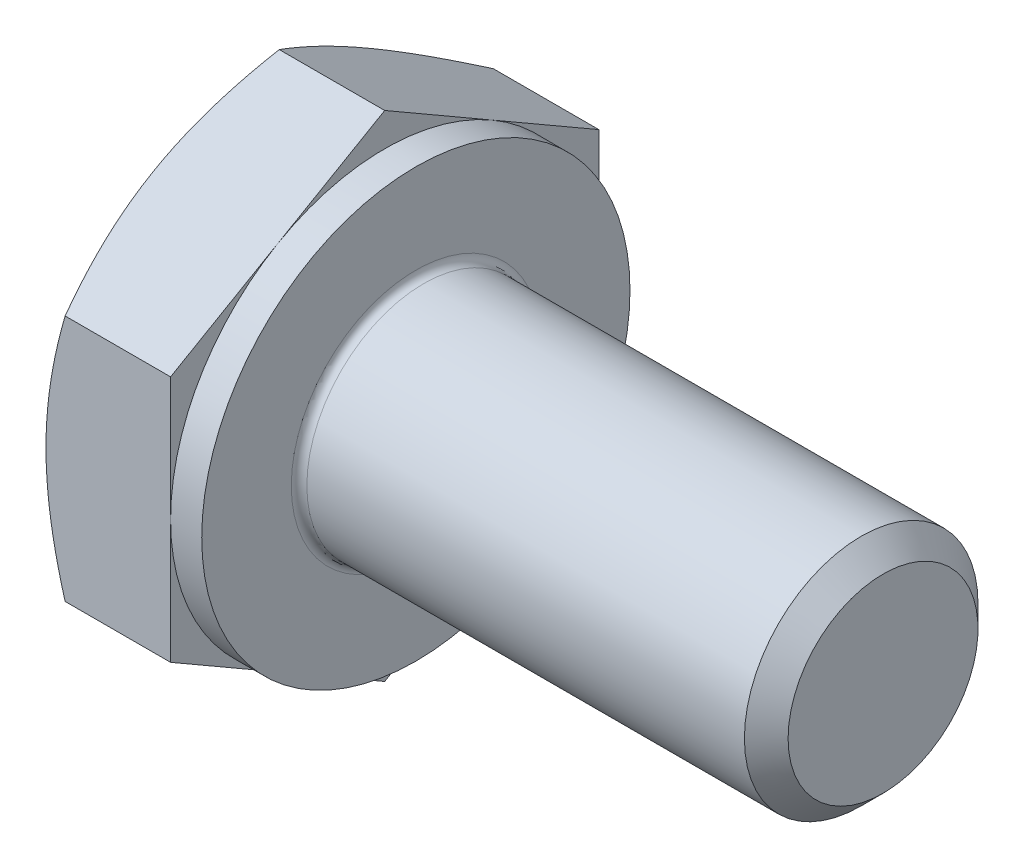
ISO-10303-21;
HEADER;
FILE_DESCRIPTION(('STEP AP214'),'2;1');
FILE_NAME('part.step','',(''),(''),'','','');
FILE_SCHEMA(('AUTOMOTIVE_DESIGN { 1 0 10303 214 1 1 1 1 }'));
ENDSEC;
DATA;
#1=APPLICATION_CONTEXT('core data for automotive mechanical design processes');
#2=APPLICATION_PROTOCOL_DEFINITION('international standard','automotive_design',2000,#1);
#3=PRODUCT_CONTEXT('',#1,'mechanical');
#4=PRODUCT('Part','Part','',(#3));
#5=PRODUCT_RELATED_PRODUCT_CATEGORY('part','',(#4));
#6=PRODUCT_DEFINITION_FORMATION('','',#4);
#7=PRODUCT_DEFINITION_CONTEXT('part definition',#1,'design');
#8=PRODUCT_DEFINITION('design','',#6,#7);
#9=PRODUCT_DEFINITION_SHAPE('','',#8);
#10=(LENGTH_UNIT() NAMED_UNIT(*) SI_UNIT(.MILLI.,.METRE.));
#11=(NAMED_UNIT(*) PLANE_ANGLE_UNIT() SI_UNIT($,.RADIAN.));
#12=(NAMED_UNIT(*) SI_UNIT($,.STERADIAN.) SOLID_ANGLE_UNIT());
#13=UNCERTAINTY_MEASURE_WITH_UNIT(LENGTH_MEASURE(1.E-05),#10,'distance_accuracy_value','');
#14=(GEOMETRIC_REPRESENTATION_CONTEXT(3) GLOBAL_UNCERTAINTY_ASSIGNED_CONTEXT((#13)) GLOBAL_UNIT_ASSIGNED_CONTEXT((#10,
#11,#12)) REPRESENTATION_CONTEXT('',''));
#15=CARTESIAN_POINT('',(0.,0.,0.));
#16=DIRECTION('',(0.,0.,1.));
#17=DIRECTION('',(1.,0.,0.));
#18=AXIS2_PLACEMENT_3D('',#15,#16,#17);
#19=CARTESIAN_POINT('',(2.,3.17542648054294,0.));
#20=DIRECTION('',(1.,0.,0.));
#21=DIRECTION('',(0.,0.,-1.));
#22=AXIS2_PLACEMENT_3D('',#19,#20,#21);
#23=PLANE('',#22);
#24=CARTESIAN_POINT('',(2.,0.,0.));
#25=DIRECTION('',(1.,0.,0.));
#26=DIRECTION('',(0.,0.,-1.));
#27=AXIS2_PLACEMENT_3D('',#24,#25,#26);
#28=CIRCLE('',#27,1.6);
#29=CARTESIAN_POINT('',(2.,0.,-1.6));
#30=VERTEX_POINT('',#29);
#31=EDGE_CURVE('E44',#30,#30,#28,.F.);
#32=ORIENTED_EDGE('',*,*,#31,.T.);
#33=EDGE_LOOP('',(#32));
#34=FACE_BOUND('',#33,.T.);
#35=CARTESIAN_POINT('',(2.,0.,0.));
#36=DIRECTION('',(1.,0.,0.));
#37=DIRECTION('',(0.,0.,-1.));
#38=AXIS2_PLACEMENT_3D('',#35,#36,#37);
#39=CIRCLE('',#38,2.75);
#40=CARTESIAN_POINT('',(2.,0.,-2.75));
#41=VERTEX_POINT('',#40);
#42=EDGE_CURVE('E301',#41,#41,#39,.T.);
#43=ORIENTED_EDGE('',*,*,#42,.T.);
#44=EDGE_LOOP('',(#43));
#45=FACE_BOUND('',#44,.T.);
#46=ADVANCED_FACE('F36',(#34,#45),#23,.T.);
#47=CARTESIAN_POINT('',(0.,0.,0.));
#48=DIRECTION('',(-1.,0.,0.));
#49=DIRECTION('',(0.,0.,1.));
#50=AXIS2_PLACEMENT_3D('',#47,#48,#49);
#51=CYLINDRICAL_SURFACE('',#50,1.5);
#52=CARTESIAN_POINT('',(2.1,0.,0.));
#53=DIRECTION('',(1.,0.,0.));
#54=DIRECTION('',(0.,0.,-1.));
#55=AXIS2_PLACEMENT_3D('',#52,#53,#54);
#56=CIRCLE('',#55,1.5);
#57=CARTESIAN_POINT('',(2.1,0.,-1.5));
#58=VERTEX_POINT('',#57);
#59=EDGE_CURVE('E11',#58,#58,#56,.T.);
#60=ORIENTED_EDGE('',*,*,#59,.T.);
#61=EDGE_LOOP('',(#60));
#62=FACE_BOUND('',#61,.T.);
#63=CARTESIAN_POINT('',(7.71950000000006,0.,0.));
#64=DIRECTION('',(-1.,0.,0.));
#65=DIRECTION('',(0.,0.,1.));
#66=AXIS2_PLACEMENT_3D('',#63,#64,#65);
#67=CIRCLE('',#66,1.5);
#68=CARTESIAN_POINT('',(7.71950000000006,0.,1.5));
#69=VERTEX_POINT('',#68);
#70=EDGE_CURVE('E280',#69,#69,#67,.T.);
#71=ORIENTED_EDGE('',*,*,#70,.T.);
#72=EDGE_LOOP('',(#71));
#73=FACE_BOUND('',#72,.T.);
#74=ADVANCED_FACE('F254',(#62,#73),#51,.T.);
#75=CARTESIAN_POINT('',(8.00000000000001,0.,0.));
#76=DIRECTION('',(-1.,0.,0.));
#77=DIRECTION('',(0.,0.,1.));
#78=AXIS2_PLACEMENT_3D('',#75,#76,#77);
#79=CONICAL_SURFACE('',#78,1.2195,0.785398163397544);
#80=ORIENTED_EDGE('',*,*,#70,.F.);
#81=EDGE_LOOP('',(#80));
#82=FACE_BOUND('',#81,.T.);
#83=CARTESIAN_POINT('',(8.00000000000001,0.,0.));
#84=DIRECTION('',(-1.,0.,0.));
#85=DIRECTION('',(0.,0.,1.));
#86=AXIS2_PLACEMENT_3D('',#83,#84,#85);
#87=CIRCLE('',#86,1.2195);
#88=CARTESIAN_POINT('',(8.00000000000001,0.,1.2195));
#89=VERTEX_POINT('',#88);
#90=EDGE_CURVE('E278',#89,#89,#87,.T.);
#91=ORIENTED_EDGE('',*,*,#90,.T.);
#92=EDGE_LOOP('',(#91));
#93=FACE_BOUND('',#92,.T.);
#94=ADVANCED_FACE('F259',(#82,#93),#79,.T.);
#95=CARTESIAN_POINT('',(8.00000000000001,0.,0.));
#96=DIRECTION('',(-1.,0.,0.));
#97=DIRECTION('',(0.,0.,1.));
#98=AXIS2_PLACEMENT_3D('',#95,#96,#97);
#99=PLANE('',#98);
#100=ORIENTED_EDGE('',*,*,#90,.F.);
#101=EDGE_LOOP('',(#100));
#102=FACE_BOUND('',#101,.T.);
#103=ADVANCED_FACE('F266',(#102),#99,.F.);
#104=CARTESIAN_POINT('',(1.6,2.75,0.));
#105=DIRECTION('',(1.,0.,0.));
#106=DIRECTION('',(0.,0.,-1.));
#107=AXIS2_PLACEMENT_3D('',#104,#105,#106);
#108=PLANE('',#107);
#109=DIRECTION('',(0.,0.500000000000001,0.866025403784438));
#110=VECTOR('',#109,1.);
#111=CARTESIAN_POINT('',(1.6,1.58771324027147,-2.75));
#112=LINE('',#111,#110);
#113=CARTESIAN_POINT('',(1.6,1.58771324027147,-2.75));
#114=VERTEX_POINT('',#113);
#115=CARTESIAN_POINT('',(1.6,2.3815698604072,-1.375));
#116=VERTEX_POINT('',#115);
#117=EDGE_CURVE('E168',#114,#116,#112,.T.);
#118=ORIENTED_EDGE('',*,*,#117,.T.);
#119=CARTESIAN_POINT('',(1.6,0.,0.));
#120=DIRECTION('',(-1.,0.,0.));
#121=DIRECTION('',(0.,0.,1.));
#122=AXIS2_PLACEMENT_3D('',#119,#120,#121);
#123=CIRCLE('',#122,2.75);
#124=CARTESIAN_POINT('',(1.6,0.,-2.75));
#125=VERTEX_POINT('',#124);
#126=EDGE_CURVE('E51',#116,#125,#123,.T.);
#127=ORIENTED_EDGE('',*,*,#126,.T.);
#128=DIRECTION('',(0.,1.,0.));
#129=VECTOR('',#128,1.);
#130=CARTESIAN_POINT('',(1.6,1.58771324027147,-2.75));
#131=LINE('',#130,#129);
#132=EDGE_CURVE('E304',#125,#114,#131,.T.);
#133=ORIENTED_EDGE('',*,*,#132,.T.);
#134=EDGE_LOOP('',(#118,#127,#133));
#135=FACE_BOUND('',#134,.T.);
#136=ADVANCED_FACE('F269',(#135),#108,.T.);
#137=CARTESIAN_POINT('',(1.6,3.17542648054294,0.));
#138=VERTEX_POINT('',#137);
#139=EDGE_CURVE('E166',#116,#138,#112,.T.);
#140=ORIENTED_EDGE('',*,*,#139,.T.);
#141=DIRECTION('',(0.,-0.5,0.866025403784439));
#142=VECTOR('',#141,1.);
#143=CARTESIAN_POINT('',(1.6,3.17542648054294,0.));
#144=LINE('',#143,#142);
#145=CARTESIAN_POINT('',(1.6,2.38156986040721,1.375));
#146=VERTEX_POINT('',#145);
#147=EDGE_CURVE('E165',#138,#146,#144,.T.);
#148=ORIENTED_EDGE('',*,*,#147,.T.);
#149=EDGE_CURVE('E154',#146,#116,#123,.T.);
#150=ORIENTED_EDGE('',*,*,#149,.T.);
#151=EDGE_LOOP('',(#140,#148,#150));
#152=FACE_BOUND('',#151,.T.);
#153=ADVANCED_FACE('F274',(#152),#108,.T.);
#154=CARTESIAN_POINT('',(1.6,1.58771324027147,2.75));
#155=VERTEX_POINT('',#154);
#156=EDGE_CURVE('E133',#146,#155,#144,.T.);
#157=ORIENTED_EDGE('',*,*,#156,.T.);
#158=DIRECTION('',(0.,-1.,0.));
#159=VECTOR('',#158,1.);
#160=CARTESIAN_POINT('',(1.6,1.58771324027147,2.75));
#161=LINE('',#160,#159);
#162=CARTESIAN_POINT('',(1.6,0.,2.75));
#163=VERTEX_POINT('',#162);
#164=EDGE_CURVE('E127',#155,#163,#161,.T.);
#165=ORIENTED_EDGE('',*,*,#164,.T.);
#166=EDGE_CURVE('E131',#163,#146,#123,.T.);
#167=ORIENTED_EDGE('',*,*,#166,.T.);
#168=EDGE_LOOP('',(#157,#165,#167));
#169=FACE_BOUND('',#168,.T.);
#170=ADVANCED_FACE('F129',(#169),#108,.T.);
#171=CARTESIAN_POINT('',(1.6,-1.58771324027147,2.75));
#172=VERTEX_POINT('',#171);
#173=EDGE_CURVE('E137',#163,#172,#161,.T.);
#174=ORIENTED_EDGE('',*,*,#173,.T.);
#175=DIRECTION('',(0.,-0.500000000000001,-0.866025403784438));
#176=VECTOR('',#175,1.);
#177=CARTESIAN_POINT('',(1.6,-3.17542648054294,0.));
#178=LINE('',#177,#176);
#179=CARTESIAN_POINT('',(1.6,-2.3815698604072,1.375));
#180=VERTEX_POINT('',#179);
#181=EDGE_CURVE('E144',#172,#180,#178,.T.);
#182=ORIENTED_EDGE('',*,*,#181,.T.);
#183=EDGE_CURVE('E141',#180,#163,#123,.T.);
#184=ORIENTED_EDGE('',*,*,#183,.T.);
#185=EDGE_LOOP('',(#174,#182,#184));
#186=FACE_BOUND('',#185,.T.);
#187=ADVANCED_FACE('F142',(#186),#108,.T.);
#188=CARTESIAN_POINT('',(1.6,-3.17542648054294,0.));
#189=VERTEX_POINT('',#188);
#190=EDGE_CURVE('E160',#180,#189,#178,.T.);
#191=ORIENTED_EDGE('',*,*,#190,.T.);
#192=DIRECTION('',(0.,0.499999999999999,-0.866025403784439));
#193=VECTOR('',#192,1.);
#194=CARTESIAN_POINT('',(1.6,-1.58771324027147,-2.75));
#195=LINE('',#194,#193);
#196=CARTESIAN_POINT('',(1.6,-2.38156986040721,-1.375));
#197=VERTEX_POINT('',#196);
#198=EDGE_CURVE('E342',#189,#197,#195,.T.);
#199=ORIENTED_EDGE('',*,*,#198,.T.);
#200=EDGE_CURVE('E148',#197,#180,#123,.T.);
#201=ORIENTED_EDGE('',*,*,#200,.T.);
#202=EDGE_LOOP('',(#191,#199,#201));
#203=FACE_BOUND('',#202,.T.);
#204=ADVANCED_FACE('F343',(#203),#108,.T.);
#205=CARTESIAN_POINT('',(1.6,-1.58771324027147,-2.75));
#206=VERTEX_POINT('',#205);
#207=EDGE_CURVE('E155',#197,#206,#195,.T.);
#208=ORIENTED_EDGE('',*,*,#207,.T.);
#209=EDGE_CURVE('E305',#206,#125,#131,.T.);
#210=ORIENTED_EDGE('',*,*,#209,.T.);
#211=EDGE_CURVE('E312',#125,#197,#123,.T.);
#212=ORIENTED_EDGE('',*,*,#211,.T.);
#213=EDGE_LOOP('',(#208,#210,#212));
#214=FACE_BOUND('',#213,.T.);
#215=ADVANCED_FACE('F275',(#214),#108,.T.);
#216=CARTESIAN_POINT('',(0.,0.,0.));
#217=DIRECTION('',(-1.,0.,0.));
#218=DIRECTION('',(0.,0.,1.));
#219=AXIS2_PLACEMENT_3D('',#216,#217,#218);
#220=CYLINDRICAL_SURFACE('',#219,2.75);
#221=ORIENTED_EDGE('',*,*,#126,.F.);
#222=ORIENTED_EDGE('',*,*,#149,.F.);
#223=ORIENTED_EDGE('',*,*,#166,.F.);
#224=ORIENTED_EDGE('',*,*,#183,.F.);
#225=ORIENTED_EDGE('',*,*,#200,.F.);
#226=ORIENTED_EDGE('',*,*,#211,.F.);
#227=EDGE_LOOP('',(#221,#222,#223,#224,#225,#226));
#228=FACE_BOUND('',#227,.T.);
#229=ORIENTED_EDGE('',*,*,#42,.F.);
#230=EDGE_LOOP('',(#229));
#231=FACE_BOUND('',#230,.T.);
#232=ADVANCED_FACE('F151',(#228,#231),#220,.T.);
#233=CARTESIAN_POINT('',(0.,3.17542648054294,0.));
#234=DIRECTION('',(1.,0.,0.));
#235=DIRECTION('',(0.,0.,-1.));
#236=AXIS2_PLACEMENT_3D('',#233,#234,#235);
#237=PLANE('',#236);
#238=CARTESIAN_POINT('',(0.,0.,0.));
#239=DIRECTION('',(1.,0.,0.));
#240=DIRECTION('',(0.,0.,-1.));
#241=AXIS2_PLACEMENT_3D('',#238,#239,#240);
#242=CIRCLE('',#241,2.75);
#243=CARTESIAN_POINT('',(0.,0.,-2.75));
#244=VERTEX_POINT('',#243);
#245=CARTESIAN_POINT('',(0.,2.3815698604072,-1.375));
#246=VERTEX_POINT('',#245);
#247=EDGE_CURVE('E300',#244,#246,#242,.T.);
#248=ORIENTED_EDGE('',*,*,#247,.F.);
#249=CARTESIAN_POINT('',(0.,-2.38156986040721,-1.375));
#250=VERTEX_POINT('',#249);
#251=EDGE_CURVE('E296',#250,#244,#242,.T.);
#252=ORIENTED_EDGE('',*,*,#251,.F.);
#253=CARTESIAN_POINT('',(0.,-2.3815698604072,1.375));
#254=VERTEX_POINT('',#253);
#255=EDGE_CURVE('E299',#254,#250,#242,.T.);
#256=ORIENTED_EDGE('',*,*,#255,.F.);
#257=CARTESIAN_POINT('',(0.,0.,2.75));
#258=VERTEX_POINT('',#257);
#259=EDGE_CURVE('E335',#258,#254,#242,.T.);
#260=ORIENTED_EDGE('',*,*,#259,.F.);
#261=CARTESIAN_POINT('',(0.,0.,0.));
#262=DIRECTION('',(-1.,0.,0.));
#263=DIRECTION('',(0.,0.,1.));
#264=AXIS2_PLACEMENT_3D('',#261,#262,#263);
#265=CIRCLE('',#264,2.75);
#266=CARTESIAN_POINT('',(0.,2.38156986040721,1.375));
#267=VERTEX_POINT('',#266);
#268=EDGE_CURVE('E169',#258,#267,#265,.T.);
#269=ORIENTED_EDGE('',*,*,#268,.T.);
#270=EDGE_CURVE('E358',#246,#267,#242,.T.);
#271=ORIENTED_EDGE('',*,*,#270,.F.);
#272=EDGE_LOOP('',(#248,#252,#256,#260,#269,#271));
#273=FACE_BOUND('',#272,.T.);
#274=ADVANCED_FACE('F200',(#273),#237,.F.);
#275=CARTESIAN_POINT('',(0.,0.,0.));
#276=DIRECTION('',(1.,0.,0.));
#277=DIRECTION('',(0.,0.,-1.));
#278=AXIS2_PLACEMENT_3D('',#275,#276,#277);
#279=CONICAL_SURFACE('',#278,2.75,1.0471975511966);
#280=CARTESIAN_POINT('',(0.24568676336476,1.58759777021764,2.7502));
#281=CARTESIAN_POINT('',(0.205387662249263,1.65737010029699,2.62935077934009));
#282=CARTESIAN_POINT('',(0.168736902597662,1.72774469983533,2.50745839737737));
#283=CARTESIAN_POINT('',(0.104762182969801,1.86971254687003,2.26156287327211));
#284=CARTESIAN_POINT('',(0.0774608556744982,1.94130831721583,2.13755536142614));
#285=CARTESIAN_POINT('',(0.034961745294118,2.08361254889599,1.89107720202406));
#286=CARTESIAN_POINT('',(0.019481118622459,2.15429911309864,1.76864448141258));
#287=CARTESIAN_POINT('',(0.000999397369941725,2.29600490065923,1.52320285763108));
#288=CARTESIAN_POINT('',(-0.00201700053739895,2.36702360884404,1.40019484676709));
#289=CARTESIAN_POINT('',(0.0042531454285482,2.49972966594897,1.17034121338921));
#290=CARTESIAN_POINT('',(0.012000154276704,2.56143686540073,1.06346120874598));
#291=CARTESIAN_POINT('',(0.0365551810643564,2.68444923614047,0.85039753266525));
#292=CARTESIAN_POINT('',(0.0533715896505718,2.74575398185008,0.74421459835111));
#293=CARTESIAN_POINT('',(0.0954119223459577,2.86902004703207,0.530711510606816));
#294=CARTESIAN_POINT('',(0.120814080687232,2.93096576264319,0.423418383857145));
#295=CARTESIAN_POINT('',(0.178467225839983,3.05393320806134,0.210432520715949));
#296=CARTESIAN_POINT('',(0.210704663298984,3.11495651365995,0.104737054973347));
#297=CARTESIAN_POINT('',(0.245686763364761,3.17554195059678,-0.00020000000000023));
#298=B_SPLINE_CURVE_WITH_KNOTS('',3,(#280,#281,#282,#283,#284,#285,#286,#287,#288,#289,#290,
#291,#292,#293,#294,#295,#296,#297),.UNSPECIFIED.,.F.,.F.,(4,2,2,2,2,2,2,2,4),(0.,
0.435912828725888,0.872873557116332,1.29901931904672,1.72464171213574,2.09526089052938,
2.46622354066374,2.84541551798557,3.22386274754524),.UNSPECIFIED.);
#299=CARTESIAN_POINT('',(0.245620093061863,3.17542648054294,0.));
#300=VERTEX_POINT('',#299);
#301=EDGE_CURVE('E220',#267,#300,#298,.T.);
#302=ORIENTED_EDGE('',*,*,#301,.T.);
#303=CARTESIAN_POINT('',(0.245686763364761,3.17554195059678,0.0002));
#304=CARTESIAN_POINT('',(0.205387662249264,3.10576962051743,-0.120649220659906));
#305=CARTESIAN_POINT('',(0.168736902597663,3.03539502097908,-0.242541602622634));
#306=CARTESIAN_POINT('',(0.104762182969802,2.89342717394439,-0.488437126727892));
#307=CARTESIAN_POINT('',(0.0774608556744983,2.82183140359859,-0.612444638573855));
#308=CARTESIAN_POINT('',(0.0349617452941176,2.67952717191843,-0.858922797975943));
#309=CARTESIAN_POINT('',(0.0194811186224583,2.60884060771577,-0.981355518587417));
#310=CARTESIAN_POINT('',(0.000999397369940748,2.46713482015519,-1.22679714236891));
#311=CARTESIAN_POINT('',(-0.00201700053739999,2.39611611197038,-1.34980515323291));
#312=CARTESIAN_POINT('',(0.00425314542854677,2.26341005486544,-1.57965878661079));
#313=CARTESIAN_POINT('',(0.0120001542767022,2.20170285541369,-1.68653879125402));
#314=CARTESIAN_POINT('',(0.0365551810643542,2.07869048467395,-1.89960246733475));
#315=CARTESIAN_POINT('',(0.0533715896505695,2.01738573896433,-2.00578540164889));
#316=CARTESIAN_POINT('',(0.0954119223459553,1.89411967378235,-2.21928848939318));
#317=CARTESIAN_POINT('',(0.12081408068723,1.83217395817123,-2.32658161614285));
#318=CARTESIAN_POINT('',(0.178467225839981,1.70920651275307,-2.53956747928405));
#319=CARTESIAN_POINT('',(0.210704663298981,1.64818320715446,-2.64526294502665));
#320=CARTESIAN_POINT('',(0.245686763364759,1.58759777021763,-2.7502));
#321=B_SPLINE_CURVE_WITH_KNOTS('',3,(#303,#304,#305,#306,#307,#308,#309,#310,#311,#312,#313,
#314,#315,#316,#317,#318,#319,#320),.UNSPECIFIED.,.F.,.F.,(4,2,2,2,2,2,2,2,4),(0.,
0.435912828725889,0.872873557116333,1.29901931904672,1.72464171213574,2.09526089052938,
2.46622354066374,2.84541551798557,3.22386274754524),.UNSPECIFIED.);
#322=EDGE_CURVE('E59',#300,#246,#321,.T.);
#323=ORIENTED_EDGE('',*,*,#322,.T.);
#324=ORIENTED_EDGE('',*,*,#270,.T.);
#325=EDGE_LOOP('',(#302,#323,#324));
#326=FACE_BOUND('',#325,.T.);
#327=ADVANCED_FACE('F359',(#326),#279,.T.);
#328=CARTESIAN_POINT('',(1.36715210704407,-4.31638594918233,2.75));
#329=CARTESIAN_POINT('',(1.30845994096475,-4.19581737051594,2.75));
#330=CARTESIAN_POINT('',(1.25031586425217,-4.07497746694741,2.75));
#331=CARTESIAN_POINT('',(1.1354311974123,-3.83261088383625,2.75));
#332=CARTESIAN_POINT('',(1.07869081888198,-3.71108410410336,2.75));
#333=CARTESIAN_POINT('',(0.966646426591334,-3.46659808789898,2.75));
#334=CARTESIAN_POINT('',(0.911351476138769,-3.34363468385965,2.75));
#335=CARTESIAN_POINT('',(0.802956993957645,-3.09674757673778,2.75));
#336=CARTESIAN_POINT('',(0.749857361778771,-2.97282391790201,2.75));
#337=CARTESIAN_POINT('',(0.644703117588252,-2.71965806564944,2.75));
#338=CARTESIAN_POINT('',(0.592742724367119,-2.59037652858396,2.75));
#339=CARTESIAN_POINT('',(0.492631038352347,-2.33032018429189,2.75));
#340=CARTESIAN_POINT('',(0.444480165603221,-2.19954521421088,2.75));
#341=CARTESIAN_POINT('',(0.353213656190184,-1.9365223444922,2.75));
#342=CARTESIAN_POINT('',(0.310088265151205,-1.80427786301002,2.75));
#343=CARTESIAN_POINT('',(0.230222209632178,-1.53789259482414,2.75));
#344=CARTESIAN_POINT('',(0.193479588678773,-1.40375240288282,2.75));
#345=CARTESIAN_POINT('',(0.128302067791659,-1.13423793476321,2.75));
#346=CARTESIAN_POINT('',(0.0998212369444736,-0.998874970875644,2.75));
#347=CARTESIAN_POINT('',(0.0527456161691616,-0.726413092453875,2.75));
#348=CARTESIAN_POINT('',(0.0341497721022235,-0.589314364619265,2.75));
#349=CARTESIAN_POINT('',(0.0085685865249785,-0.315877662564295,2.75));
#350=CARTESIAN_POINT('',(0.00142992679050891,-0.179554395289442,2.75));
#351=CARTESIAN_POINT('',(-0.0010386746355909,0.0932131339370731,2.75));
#352=CARTESIAN_POINT('',(0.00363158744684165,0.229657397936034,2.75));
#353=CARTESIAN_POINT('',(0.0211304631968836,0.459764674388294,2.75));
#354=CARTESIAN_POINT('',(0.0310050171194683,0.553667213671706,2.75));
#355=CARTESIAN_POINT('',(0.0557601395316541,0.740814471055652,2.75));
#356=CARTESIAN_POINT('',(0.0706413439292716,0.834059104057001,2.75));
#357=CARTESIAN_POINT('',(0.122015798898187,1.1126628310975,2.75));
#358=CARTESIAN_POINT('',(0.165231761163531,1.29679769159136,2.75));
#359=CARTESIAN_POINT('',(0.240559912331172,1.57226006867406,2.75));
#360=CARTESIAN_POINT('',(0.267790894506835,1.66500394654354,2.75));
#361=CARTESIAN_POINT('',(0.325176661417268,1.84959145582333,2.75));
#362=CARTESIAN_POINT('',(0.35533146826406,1.94143508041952,2.75));
#363=CARTESIAN_POINT('',(0.418073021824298,2.12425036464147,2.75));
#364=CARTESIAN_POINT('',(0.450659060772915,2.21522226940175,2.75));
#365=CARTESIAN_POINT('',(0.517870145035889,2.39640501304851,2.75));
#366=CARTESIAN_POINT('',(0.552495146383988,2.48661586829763,2.75));
#367=CARTESIAN_POINT('',(0.647111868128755,2.72631941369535,2.75));
#368=CARTESIAN_POINT('',(0.708617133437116,2.87521406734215,2.75));
#369=CARTESIAN_POINT('',(0.835163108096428,3.17149877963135,2.75));
#370=CARTESIAN_POINT('',(0.90020418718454,3.31888867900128,2.75));
#371=CARTESIAN_POINT('',(1.03299372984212,3.61249860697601,2.75));
#372=CARTESIAN_POINT('',(1.1007430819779,3.75871823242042,2.75));
#373=CARTESIAN_POINT('',(1.23832197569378,4.05017738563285,2.75));
#374=CARTESIAN_POINT('',(1.30815157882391,4.19541688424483,2.75));
#375=CARTESIAN_POINT('',(1.5202722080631,4.63039070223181,2.75));
#376=CARTESIAN_POINT('',(1.66499194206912,4.91893915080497,2.75));
#377=CARTESIAN_POINT('',(1.95851426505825,5.49386340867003,2.75));
#378=CARTESIAN_POINT('',(2.10731603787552,5.78023963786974,2.75));
#379=CARTESIAN_POINT('',(2.39216757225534,6.32194576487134,2.75));
#380=CARTESIAN_POINT('',(2.52794261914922,6.57742037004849,2.75));
#381=CARTESIAN_POINT('',(2.80114245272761,7.08750371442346,2.75));
#382=CARTESIAN_POINT('',(2.93856733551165,7.342112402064,2.75));
#383=CARTESIAN_POINT('',(3.21419429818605,7.84983547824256,2.75));
#384=CARTESIAN_POINT('',(3.35239239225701,8.10295203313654,2.75));
#385=CARTESIAN_POINT('',(3.62973059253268,8.60864374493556,2.75));
#386=CARTESIAN_POINT('',(3.76887062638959,8.86121894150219,2.75));
#387=CARTESIAN_POINT('',(3.9083538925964,9.11360311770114,2.75));
#388=B_SPLINE_CURVE_WITH_KNOTS('',3,(#328,#329,#330,#331,#332,#333,#334,#335,#336,#337,#338,
#339,#340,#341,#342,#343,#344,#345,#346,#347,#348,#349,#350,#351,#352,#353,#354,#355,#356,#357,
#358,#359,#360,#361,#362,#363,#364,#365,#366,#367,#368,#369,#370,#371,#372,#373,#374,#375,#376,
#377,#378,#379,#380,#381,#382,#383,#384,#385,#386,#387),.UNSPECIFIED.,.F.,.F.,(4,2,2,2,2,2,2,2,
2,2,2,2,2,2,2,2,2,2,2,2,2,2,2,2,2,2,2,2,2,4),(0.,0.40229060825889,0.804641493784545,
1.20909649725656,1.61353297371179,2.03148461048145,2.44948226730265,2.86665458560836,
3.28369880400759,3.69837799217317,4.11301294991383,4.52205162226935,4.9310973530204,
5.21422195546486,5.49738253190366,6.06398562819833,6.35393648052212,6.64388952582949,
6.933758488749,7.2236212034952,7.70684704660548,8.19012351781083,8.67355987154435,
9.15701054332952,10.1253686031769,11.0935344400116,11.9614658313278,12.8294480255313,
13.694604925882,14.5596961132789),.UNSPECIFIED.);
#389=CARTESIAN_POINT('',(0.245620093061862,1.58771324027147,2.75));
#390=VERTEX_POINT('',#389);
#391=EDGE_CURVE('E234',#258,#390,#388,.T.);
#392=ORIENTED_EDGE('',*,*,#391,.T.);
#393=EDGE_CURVE('E233',#390,#267,#298,.T.);
#394=ORIENTED_EDGE('',*,*,#393,.T.);
#395=ORIENTED_EDGE('',*,*,#268,.F.);
#396=EDGE_LOOP('',(#392,#394,#395));
#397=FACE_BOUND('',#396,.T.);
#398=ADVANCED_FACE('F329',(#397),#279,.T.);
#399=CARTESIAN_POINT('',(0.245620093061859,-1.58771324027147,2.75));
#400=VERTEX_POINT('',#399);
#401=EDGE_CURVE('E281',#400,#258,#388,.T.);
#402=ORIENTED_EDGE('',*,*,#401,.T.);
#403=ORIENTED_EDGE('',*,*,#259,.T.);
#404=CARTESIAN_POINT('',(0.245686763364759,-3.17554195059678,-0.000199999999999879));
#405=CARTESIAN_POINT('',(0.205387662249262,-3.10576962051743,0.120649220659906));
#406=CARTESIAN_POINT('',(0.168736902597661,-3.03539502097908,0.242541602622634));
#407=CARTESIAN_POINT('',(0.1047621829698,-2.89342717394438,0.488437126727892));
#408=CARTESIAN_POINT('',(0.0774608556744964,-2.82183140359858,0.612444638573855));
#409=CARTESIAN_POINT('',(0.0349617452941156,-2.67952717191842,0.858922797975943));
#410=CARTESIAN_POINT('',(0.0194811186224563,-2.60884060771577,0.981355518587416));
#411=CARTESIAN_POINT('',(0.000999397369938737,-2.46713482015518,1.22679714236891));
#412=CARTESIAN_POINT('',(-0.00201700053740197,-2.39611611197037,1.34980515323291));
#413=CARTESIAN_POINT('',(0.00425314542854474,-2.26341005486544,1.57965878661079));
#414=CARTESIAN_POINT('',(0.0120001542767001,-2.20170285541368,1.68653879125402));
#415=CARTESIAN_POINT('',(0.0365551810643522,-2.07869048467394,1.89960246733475));
#416=CARTESIAN_POINT('',(0.0533715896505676,-2.01738573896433,2.00578540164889));
#417=CARTESIAN_POINT('',(0.0954119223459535,-1.89411967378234,2.21928848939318));
#418=CARTESIAN_POINT('',(0.120814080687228,-1.83217395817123,2.32658161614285));
#419=CARTESIAN_POINT('',(0.178467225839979,-1.70920651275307,2.53956747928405));
#420=CARTESIAN_POINT('',(0.210704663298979,-1.64818320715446,2.64526294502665));
#421=CARTESIAN_POINT('',(0.245686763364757,-1.58759777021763,2.7502));
#422=B_SPLINE_CURVE_WITH_KNOTS('',3,(#404,#405,#406,#407,#408,#409,#410,#411,#412,#413,#414,
#415,#416,#417,#418,#419,#420,#421),.UNSPECIFIED.,.F.,.F.,(4,2,2,2,2,2,2,2,4),(0.,
0.435912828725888,0.872873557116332,1.29901931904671,1.72464171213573,2.09526089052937,
2.46622354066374,2.84541551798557,3.22386274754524),.UNSPECIFIED.);
#423=EDGE_CURVE('E222',#254,#400,#422,.T.);
#424=ORIENTED_EDGE('',*,*,#423,.T.);
#425=EDGE_LOOP('',(#402,#403,#424));
#426=FACE_BOUND('',#425,.T.);
#427=ADVANCED_FACE('F189',(#426),#279,.T.);
#428=CARTESIAN_POINT('',(0.245620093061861,-3.17542648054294,0.));
#429=VERTEX_POINT('',#428);
#430=EDGE_CURVE('E214',#429,#254,#422,.T.);
#431=ORIENTED_EDGE('',*,*,#430,.T.);
#432=ORIENTED_EDGE('',*,*,#255,.T.);
#433=CARTESIAN_POINT('',(0.24568676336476,-1.58759777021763,-2.7502));
#434=CARTESIAN_POINT('',(0.205387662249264,-1.65737010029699,-2.62935077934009));
#435=CARTESIAN_POINT('',(0.168736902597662,-1.72774469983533,-2.50745839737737));
#436=CARTESIAN_POINT('',(0.104762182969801,-1.86971254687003,-2.26156287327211));
#437=CARTESIAN_POINT('',(0.0774608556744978,-1.94130831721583,-2.13755536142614));
#438=CARTESIAN_POINT('',(0.0349617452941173,-2.08361254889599,-1.89107720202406));
#439=CARTESIAN_POINT('',(0.0194811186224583,-2.15429911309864,-1.76864448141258));
#440=CARTESIAN_POINT('',(0.000999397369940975,-2.29600490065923,-1.52320285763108));
#441=CARTESIAN_POINT('',(-0.0020170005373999,-2.36702360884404,-1.40019484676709));
#442=CARTESIAN_POINT('',(0.00425314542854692,-2.49972966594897,-1.17034121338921));
#443=CARTESIAN_POINT('',(0.0120001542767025,-2.56143686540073,-1.06346120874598));
#444=CARTESIAN_POINT('',(0.0365551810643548,-2.68444923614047,-0.850397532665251));
#445=CARTESIAN_POINT('',(0.0533715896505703,-2.74575398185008,-0.744214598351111));
#446=CARTESIAN_POINT('',(0.0954119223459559,-2.86902004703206,-0.530711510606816));
#447=CARTESIAN_POINT('',(0.12081408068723,-2.93096576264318,-0.423418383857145));
#448=CARTESIAN_POINT('',(0.178467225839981,-3.05393320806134,-0.210432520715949));
#449=CARTESIAN_POINT('',(0.210704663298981,-3.11495651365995,-0.104737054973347));
#450=CARTESIAN_POINT('',(0.245686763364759,-3.17554195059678,0.000199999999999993));
#451=B_SPLINE_CURVE_WITH_KNOTS('',3,(#433,#434,#435,#436,#437,#438,#439,#440,#441,#442,#443,
#444,#445,#446,#447,#448,#449,#450),.UNSPECIFIED.,.F.,.F.,(4,2,2,2,2,2,2,2,4),(0.,
0.435912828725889,0.872873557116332,1.29901931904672,1.72464171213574,2.09526089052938,
2.46622354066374,2.84541551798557,3.22386274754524),.UNSPECIFIED.);
#452=EDGE_CURVE('E221',#250,#429,#451,.T.);
#453=ORIENTED_EDGE('',*,*,#452,.T.);
#454=EDGE_LOOP('',(#431,#432,#453));
#455=FACE_BOUND('',#454,.T.);
#456=ADVANCED_FACE('F357',(#455),#279,.T.);
#457=CARTESIAN_POINT('',(0.24562009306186,1.58771324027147,-2.75));
#458=VERTEX_POINT('',#457);
#459=EDGE_CURVE('E223',#246,#458,#321,.T.);
#460=ORIENTED_EDGE('',*,*,#459,.T.);
#461=CARTESIAN_POINT('',(1.3671521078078,-4.31638595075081,-2.75));
#462=CARTESIAN_POINT('',(1.30845994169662,-4.19581737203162,-2.75));
#463=CARTESIAN_POINT('',(1.25031586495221,-4.07497746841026,-2.75));
#464=CARTESIAN_POINT('',(1.13543119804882,-3.83261088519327,-2.75));
#465=CARTESIAN_POINT('',(1.07869081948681,-3.7110841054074,-2.75));
#466=CARTESIAN_POINT('',(0.966646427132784,-3.46659808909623,-2.75));
#467=CARTESIAN_POINT('',(0.911351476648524,-3.3436346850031,-2.75));
#468=CARTESIAN_POINT('',(0.802956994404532,-3.09674757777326,-2.75));
#469=CARTESIAN_POINT('',(0.749857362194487,-2.97282391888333,-2.75));
#470=CARTESIAN_POINT('',(0.644703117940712,-2.71965806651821,-2.75));
#471=CARTESIAN_POINT('',(0.592742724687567,-2.59037652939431,-2.75));
#472=CARTESIAN_POINT('',(0.492631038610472,-2.33032018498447,-2.75));
#473=CARTESIAN_POINT('',(0.444480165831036,-2.1995452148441,-2.75));
#474=CARTESIAN_POINT('',(0.353213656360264,-1.93652234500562,-2.75));
#475=CARTESIAN_POINT('',(0.310088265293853,-1.80427786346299,-2.75));
#476=CARTESIAN_POINT('',(0.230222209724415,-1.53789259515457,-2.75));
#477=CARTESIAN_POINT('',(0.193479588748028,-1.40375240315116,-2.75));
#478=CARTESIAN_POINT('',(0.128302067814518,-1.13423793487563,-2.75));
#479=CARTESIAN_POINT('',(0.0998212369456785,-0.9988749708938,-2.75));
#480=CARTESIAN_POINT('',(0.0527456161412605,-0.726413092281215,-2.75));
#481=CARTESIAN_POINT('',(0.0341497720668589,-0.589314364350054,-2.75));
#482=CARTESIAN_POINT('',(0.0085685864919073,-0.315877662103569,-2.75));
#483=CARTESIAN_POINT('',(0.00142992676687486,-0.179554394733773,-2.75));
#484=CARTESIAN_POINT('',(-0.00103867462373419,0.0932131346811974,-2.75));
#485=CARTESIAN_POINT('',(0.00363158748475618,0.229657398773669,-2.75));
#486=CARTESIAN_POINT('',(0.0211304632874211,0.459764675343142,-2.75));
#487=CARTESIAN_POINT('',(0.0310050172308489,0.553667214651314,-2.75));
#488=CARTESIAN_POINT('',(0.0557601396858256,0.740814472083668,-2.75));
#489=CARTESIAN_POINT('',(0.070641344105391,0.834059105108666,-2.75));
#490=CARTESIAN_POINT('',(0.122015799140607,1.1126628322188,-2.75));
#491=CARTESIAN_POINT('',(0.16523176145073,1.29679769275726,-2.75));
#492=CARTESIAN_POINT('',(0.240559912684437,1.57226006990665,-2.75));
#493=CARTESIAN_POINT('',(0.267790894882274,1.66500394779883,-2.75));
#494=CARTESIAN_POINT('',(0.325176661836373,1.8495914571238,-2.75));
#495=CARTESIAN_POINT('',(0.355331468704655,1.94143508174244,-2.75));
#496=CARTESIAN_POINT('',(0.418073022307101,2.12425036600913,-2.75));
#497=CARTESIAN_POINT('',(0.450659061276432,2.21522227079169,-2.75));
#498=CARTESIAN_POINT('',(0.51787014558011,2.39640501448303,-2.75));
#499=CARTESIAN_POINT('',(0.552495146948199,2.48661586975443,-2.75));
#500=CARTESIAN_POINT('',(0.647111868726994,2.72631941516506,-2.75));
#501=CARTESIAN_POINT('',(0.708617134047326,2.87521406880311,-2.75));
#502=CARTESIAN_POINT('',(0.835163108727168,3.17149878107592,-2.75));
#503=CARTESIAN_POINT('',(0.900204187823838,3.31888868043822,-2.75));
#504=CARTESIAN_POINT('',(1.03299373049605,3.61249860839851,-2.75));
#505=CARTESIAN_POINT('',(1.10074308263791,3.7587182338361,-2.75));
#506=CARTESIAN_POINT('',(1.23832197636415,4.05017738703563,-2.75));
#507=CARTESIAN_POINT('',(1.30815157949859,4.19541688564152,-2.75));
#508=CARTESIAN_POINT('',(1.52027220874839,4.63039070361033,-2.75));
#509=CARTESIAN_POINT('',(1.6649919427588,4.91893915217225,-2.75));
#510=CARTESIAN_POINT('',(1.95851426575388,5.49386341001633,-2.75));
#511=CARTESIAN_POINT('',(2.10731603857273,5.78023963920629,-2.75));
#512=CARTESIAN_POINT('',(2.39216757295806,6.32194576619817,-2.75));
#513=CARTESIAN_POINT('',(2.52794261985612,6.57742037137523,-2.75));
#514=CARTESIAN_POINT('',(2.80114245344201,7.08750371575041,-2.75));
#515=CARTESIAN_POINT('',(2.93856733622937,7.34211240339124,-2.75));
#516=CARTESIAN_POINT('',(3.21419429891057,7.84983547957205,-2.75));
#517=CARTESIAN_POINT('',(3.35239239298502,8.10295203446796,-2.75));
#518=CARTESIAN_POINT('',(3.62973059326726,8.6086437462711,-2.75));
#519=CARTESIAN_POINT('',(3.76887062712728,8.86121894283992,-2.75));
#520=CARTESIAN_POINT('',(3.90835389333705,9.11360311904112,-2.75));
#521=B_SPLINE_CURVE_WITH_KNOTS('',3,(#461,#462,#463,#464,#465,#466,#467,#468,#469,#470,#471,
#472,#473,#474,#475,#476,#477,#478,#479,#480,#481,#482,#483,#484,#485,#486,#487,#488,#489,#490,
#491,#492,#493,#494,#495,#496,#497,#498,#499,#500,#501,#502,#503,#504,#505,#506,#507,#508,#509,
#510,#511,#512,#513,#514,#515,#516,#517,#518,#519,#520),.UNSPECIFIED.,.F.,.F.,(4,2,2,2,2,2,2,2,
2,2,2,2,2,2,2,2,2,2,2,2,2,2,2,2,2,2,2,2,2,4),(0.,0.402290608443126,0.804641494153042,
1.20909649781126,1.61353297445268,2.03148461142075,2.44948226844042,2.86665458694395,
3.28369880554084,3.69837799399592,4.11301295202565,4.52205162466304,4.93109735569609,
5.21422195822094,5.49738253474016,6.06398563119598,6.35393648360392,6.64388952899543,
6.93375849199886,7.22362120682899,7.70684704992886,8.19012352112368,8.67355987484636,
9.15701054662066,10.1253686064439,11.0935344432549,11.9614658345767,12.8294480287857,
13.6946049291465,14.5596961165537),.UNSPECIFIED.);
#522=EDGE_CURVE('E181',#458,#244,#521,.F.);
#523=ORIENTED_EDGE('',*,*,#522,.T.);
#524=ORIENTED_EDGE('',*,*,#247,.T.);
#525=EDGE_LOOP('',(#460,#523,#524));
#526=FACE_BOUND('',#525,.T.);
#527=ADVANCED_FACE('F354',(#526),#279,.T.);
#528=CARTESIAN_POINT('',(0.245620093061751,-1.58771324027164,-2.75));
#529=VERTEX_POINT('',#528);
#530=EDGE_CURVE('E182',#529,#250,#451,.T.);
#531=ORIENTED_EDGE('',*,*,#530,.T.);
#532=ORIENTED_EDGE('',*,*,#251,.T.);
#533=EDGE_CURVE('E172',#244,#529,#521,.F.);
#534=ORIENTED_EDGE('',*,*,#533,.T.);
#535=EDGE_LOOP('',(#531,#532,#534));
#536=FACE_BOUND('',#535,.T.);
#537=ADVANCED_FACE('F198',(#536),#279,.T.);
#538=CARTESIAN_POINT('',(2.,1.58771324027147,-2.75));
#539=DIRECTION('',(0.,0.,1.));
#540=DIRECTION('',(0.,-1.,0.));
#541=AXIS2_PLACEMENT_3D('',#538,#539,#540);
#542=PLANE('',#541);
#543=ORIENTED_EDGE('',*,*,#209,.F.);
#544=DIRECTION('',(-1.,0.,0.));
#545=VECTOR('',#544,1.);
#546=CARTESIAN_POINT('',(2.,-1.58771324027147,-2.75));
#547=LINE('',#546,#545);
#548=EDGE_CURVE('E287',#206,#529,#547,.T.);
#549=ORIENTED_EDGE('',*,*,#548,.T.);
#550=ORIENTED_EDGE('',*,*,#533,.F.);
#551=ORIENTED_EDGE('',*,*,#522,.F.);
#552=DIRECTION('',(-1.,0.,0.));
#553=VECTOR('',#552,1.);
#554=CARTESIAN_POINT('',(2.,1.58771324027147,-2.75));
#555=LINE('',#554,#553);
#556=EDGE_CURVE('E283',#114,#458,#555,.T.);
#557=ORIENTED_EDGE('',*,*,#556,.F.);
#558=ORIENTED_EDGE('',*,*,#132,.F.);
#559=EDGE_LOOP('',(#543,#549,#550,#551,#557,#558));
#560=FACE_BOUND('',#559,.T.);
#561=ADVANCED_FACE('F193',(#560),#542,.F.);
#562=CARTESIAN_POINT('',(2.,-1.58771324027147,-2.75));
#563=DIRECTION('',(0.,0.866025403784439,0.5));
#564=DIRECTION('',(0.,-0.499999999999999,0.866025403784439));
#565=AXIS2_PLACEMENT_3D('',#562,#563,#564);
#566=PLANE('',#565);
#567=ORIENTED_EDGE('',*,*,#198,.F.);
#568=DIRECTION('',(-1.,0.,0.));
#569=VECTOR('',#568,1.);
#570=CARTESIAN_POINT('',(2.,-3.17542648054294,0.));
#571=LINE('',#570,#569);
#572=EDGE_CURVE('E289',#189,#429,#571,.T.);
#573=ORIENTED_EDGE('',*,*,#572,.T.);
#574=ORIENTED_EDGE('',*,*,#452,.F.);
#575=ORIENTED_EDGE('',*,*,#530,.F.);
#576=ORIENTED_EDGE('',*,*,#548,.F.);
#577=ORIENTED_EDGE('',*,*,#207,.F.);
#578=EDGE_LOOP('',(#567,#573,#574,#575,#576,#577));
#579=FACE_BOUND('',#578,.T.);
#580=ADVANCED_FACE('F197',(#579),#566,.F.);
#581=CARTESIAN_POINT('',(2.,-3.17542648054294,0.));
#582=DIRECTION('',(0.,0.866025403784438,-0.500000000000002));
#583=DIRECTION('',(0.,0.500000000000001,0.866025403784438));
#584=AXIS2_PLACEMENT_3D('',#581,#582,#583);
#585=PLANE('',#584);
#586=ORIENTED_EDGE('',*,*,#181,.F.);
#587=DIRECTION('',(-1.,0.,0.));
#588=VECTOR('',#587,1.);
#589=CARTESIAN_POINT('',(2.,-1.58771324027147,2.75));
#590=LINE('',#589,#588);
#591=EDGE_CURVE('E159',#172,#400,#590,.T.);
#592=ORIENTED_EDGE('',*,*,#591,.T.);
#593=ORIENTED_EDGE('',*,*,#423,.F.);
#594=ORIENTED_EDGE('',*,*,#430,.F.);
#595=ORIENTED_EDGE('',*,*,#572,.F.);
#596=ORIENTED_EDGE('',*,*,#190,.F.);
#597=EDGE_LOOP('',(#586,#592,#593,#594,#595,#596));
#598=FACE_BOUND('',#597,.T.);
#599=ADVANCED_FACE('F205',(#598),#585,.F.);
#600=CARTESIAN_POINT('',(2.,1.58771324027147,2.75));
#601=DIRECTION('',(0.,0.,-1.));
#602=DIRECTION('',(0.,1.,0.));
#603=AXIS2_PLACEMENT_3D('',#600,#601,#602);
#604=PLANE('',#603);
#605=ORIENTED_EDGE('',*,*,#164,.F.);
#606=DIRECTION('',(-1.,0.,0.));
#607=VECTOR('',#606,1.);
#608=CARTESIAN_POINT('',(2.,1.58771324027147,2.75));
#609=LINE('',#608,#607);
#610=EDGE_CURVE('E292',#155,#390,#609,.T.);
#611=ORIENTED_EDGE('',*,*,#610,.T.);
#612=ORIENTED_EDGE('',*,*,#391,.F.);
#613=ORIENTED_EDGE('',*,*,#401,.F.);
#614=ORIENTED_EDGE('',*,*,#591,.F.);
#615=ORIENTED_EDGE('',*,*,#173,.F.);
#616=EDGE_LOOP('',(#605,#611,#612,#613,#614,#615));
#617=FACE_BOUND('',#616,.T.);
#618=ADVANCED_FACE('F157',(#617),#604,.F.);
#619=CARTESIAN_POINT('',(2.,3.17542648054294,0.));
#620=DIRECTION('',(0.,-0.866025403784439,-0.5));
#621=DIRECTION('',(0.,0.5,-0.866025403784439));
#622=AXIS2_PLACEMENT_3D('',#619,#620,#621);
#623=PLANE('',#622);
#624=ORIENTED_EDGE('',*,*,#147,.F.);
#625=DIRECTION('',(-1.,0.,0.));
#626=VECTOR('',#625,1.);
#627=CARTESIAN_POINT('',(2.,3.17542648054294,0.));
#628=LINE('',#627,#626);
#629=EDGE_CURVE('E294',#138,#300,#628,.T.);
#630=ORIENTED_EDGE('',*,*,#629,.T.);
#631=ORIENTED_EDGE('',*,*,#301,.F.);
#632=ORIENTED_EDGE('',*,*,#393,.F.);
#633=ORIENTED_EDGE('',*,*,#610,.F.);
#634=ORIENTED_EDGE('',*,*,#156,.F.);
#635=EDGE_LOOP('',(#624,#630,#631,#632,#633,#634));
#636=FACE_BOUND('',#635,.T.);
#637=ADVANCED_FACE('F240',(#636),#623,.F.);
#638=CARTESIAN_POINT('',(2.,1.58771324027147,-2.75));
#639=DIRECTION('',(0.,-0.866025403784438,0.500000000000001));
#640=DIRECTION('',(0.,-0.500000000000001,-0.866025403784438));
#641=AXIS2_PLACEMENT_3D('',#638,#639,#640);
#642=PLANE('',#641);
#643=ORIENTED_EDGE('',*,*,#117,.F.);
#644=ORIENTED_EDGE('',*,*,#556,.T.);
#645=ORIENTED_EDGE('',*,*,#459,.F.);
#646=ORIENTED_EDGE('',*,*,#322,.F.);
#647=ORIENTED_EDGE('',*,*,#629,.F.);
#648=ORIENTED_EDGE('',*,*,#139,.F.);
#649=EDGE_LOOP('',(#643,#644,#645,#646,#647,#648));
#650=FACE_BOUND('',#649,.T.);
#651=ADVANCED_FACE('F243',(#650),#642,.F.);
#652=CARTESIAN_POINT('',(2.1,0.,0.));
#653=DIRECTION('',(1.,0.,0.));
#654=DIRECTION('',(0.,0.,-1.));
#655=AXIS2_PLACEMENT_3D('',#652,#653,#654);
#656=TOROIDAL_SURFACE('',#655,1.6,0.1);
#657=ORIENTED_EDGE('',*,*,#59,.F.);
#658=EDGE_LOOP('',(#657));
#659=FACE_BOUND('',#658,.T.);
#660=ORIENTED_EDGE('',*,*,#31,.F.);
#661=EDGE_LOOP('',(#660));
#662=FACE_BOUND('',#661,.T.);
#663=ADVANCED_FACE('F38',(#659,#662),#656,.F.);
#664=CLOSED_SHELL('',(#46,#74,#94,#103,#136,#153,#170,#187,#204,#215,#232,#274,#327,#398,#427,
#456,#527,#537,#561,#580,#599,#618,#637,#651,#663));
#665=MANIFOLD_SOLID_BREP('B2',#664);
#666=ADVANCED_BREP_SHAPE_REPRESENTATION('',(#18,#665),#14);
#667=SHAPE_DEFINITION_REPRESENTATION(#9,#666);
ENDSEC;
END-ISO-10303-21;
